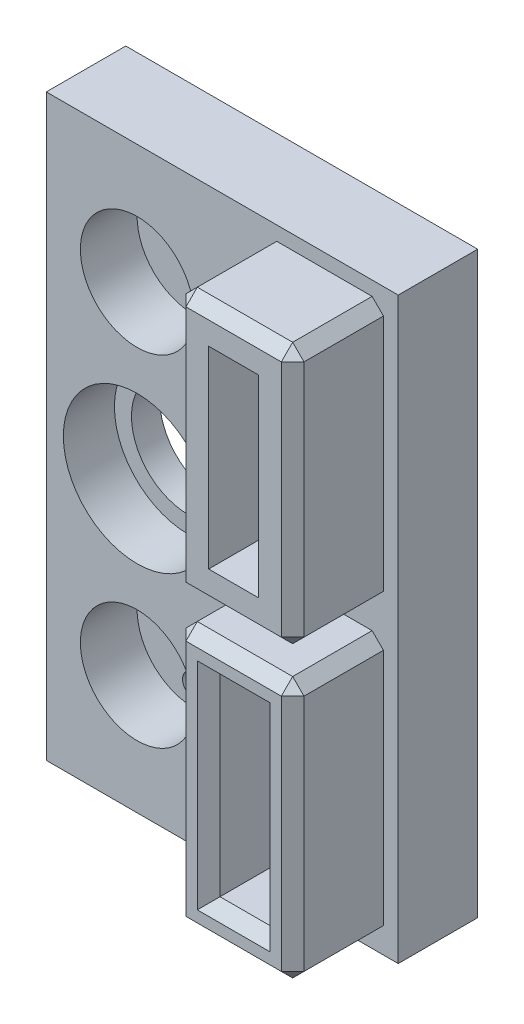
from build123d import *

# Parameters (mm, degrees)
SKETCH_1_W          = 30.82
SKETCH_1_H          = 51.6
SKETCH_1_R          = 5
SKETCH_1_R_2        = 3
EXTRUDE_1_DEPTH     = 5
SKETCH_4_W          = 30.823300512
SKETCH_4_H          = 51.6
EXTRUDE_4_DEPTH     = 2
CUT_EXTRUDE_START   = -10
SKETCH_5_R          = 3
CUT_EXTRUDE_1_DEPTH = 10
SKETCH_6_R          = 5
CUT_EXTRUDE_2_DEPTH = 2.6
SKETCH_7_R          = 6.5
CUT_EXTRUDE_3_DEPTH = 4.5
SKETCH_8_R          = 1
CUT_EXTRUDE_4_DEPTH = 10
SKETCH_11_R         = 1
CUT_EXTRUDE_6_DEPTH = 11
CUT_EXTRUDE_7_DEPTH = 11
SKETCH_14_W         = 0.29
SKETCH_14_H         = 51
EXTRUDE_7_DEPTH     = 7
SKETCH_15_W         = 2.657456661
SKETCH_15_H         = 0.18
SKETCH_15_W_2       = 31
CUT_EXTRUDE_8_DEPTH = 10
SKETCH_16_W         = 31
SKETCH_16_H         = 0.18
EXTRUDE_8_DEPTH     = 7
SKETCH_17_W         = 10.4
SKETCH_17_H         = 23
SKETCH_17_W_2       = 4.4
SKETCH_17_H_2       = 17
EXTRUDE_9_DEPTH     = 8
CHAMFER_4_SIZE      = 1


with BuildPart() as part:
    # Sketch 1 → Extrude 1 (new body)
    with BuildSketch(Plane.XY):
        with Locations((7.41, 0)):
            Rectangle(SKETCH_1_W, SKETCH_1_H)
        with Locations((0, 15)):
            Circle(SKETCH_1_R, mode=Mode.SUBTRACT)
        with Locations((0, -15)):
            Circle(SKETCH_1_R, mode=Mode.SUBTRACT)
        Circle(SKETCH_1_R_2, mode=Mode.SUBTRACT)
    extrude(amount=EXTRUDE_1_DEPTH)

    # Sketch 4 → Extrude 4 (add)
    with BuildSketch(Plane(origin=(0, 0, 0), x_dir=(-1, 0, 0), z_dir=(0, 0, -1))):
        with Locations((-7.411650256, 0)):
            Rectangle(SKETCH_4_W, SKETCH_4_H)
    extrude(amount=EXTRUDE_4_DEPTH)

    # Sketch 5 → Cut-Extrude 1 (cut)
    with BuildSketch(Plane.XY.offset(CUT_EXTRUDE_START)):
        with Locations(Location((0, 0, 0), (0, 0, 180))):
            Circle(SKETCH_5_R)
    extrude(amount=CUT_EXTRUDE_1_DEPTH, mode=Mode.SUBTRACT)

    # Sketch 6 → Cut-Extrude 2 (cut)
    with BuildSketch(Plane(origin=(0, 0, -2), x_dir=(-1, 0, 0), z_dir=(0, 0, -1))):
        Circle(SKETCH_6_R)
    extrude(amount=-CUT_EXTRUDE_2_DEPTH, mode=Mode.SUBTRACT)

    # Sketch 7 → Cut-Extrude 3 (cut)
    with BuildSketch(Plane.XY.offset(5)):
        Circle(SKETCH_7_R)
    extrude(amount=-CUT_EXTRUDE_3_DEPTH, mode=Mode.SUBTRACT)

    # Sketch 8 → Cut-Extrude 4 (cut)
    with BuildSketch(Plane.XY):
        with Locations((0, 15)):
            Circle(SKETCH_8_R)
        with Locations((0, -15)):
            Circle(SKETCH_8_R)
    extrude(amount=-CUT_EXTRUDE_4_DEPTH, mode=Mode.SUBTRACT)

    # Sketch 11 → Cut-Extrude 6 (cut)
    with BuildSketch(Plane(origin=(0, 0, -2), x_dir=(-1, 0, 0), z_dir=(0, 0, -1))):
        with Locations((0, -18.3)):
            Circle(SKETCH_11_R)
    extrude(amount=-CUT_EXTRUDE_6_DEPTH, mode=Mode.SUBTRACT)

    # Sketch 12 → Cut-Extrude 7 (cut)
    with BuildSketch(Plane.XY.offset(5)):
        Polygon((-8, -25.32), (-8, -25.8), (22.71, -25.8), (22.82, -25.8), (22.82, 25.8), (22.71, 25.8), (-8, 25.8), (-8, 25.68), (22.71, 25.68), (22.71, -25.32), align=None)
    extrude(amount=-CUT_EXTRUDE_7_DEPTH, mode=Mode.SUBTRACT)


with BuildPart() as cut_extrude_7_kept_piece:
    # of the separate pieces the step leaves, the one the design keeps (cut_extrude_7_pieces_kept)
    add(part.part.solids().sort_by_distance((-8, -25.32, 5))[0])

    # Sketch 14 → Extrude 7 (add)
    with BuildSketch(Plane(origin=(0, 0, -2), x_dir=(-1, 0, 0), z_dir=(0, 0, -1))):
        with Locations((-22.855, 0.18)):
            Rectangle(SKETCH_14_W, SKETCH_14_H)
    extrude(amount=-EXTRUDE_7_DEPTH)

    # Sketch 15 → Cut-Extrude 8 (cut)
    with BuildSketch(Plane.XY.offset(5)):
        with Locations((-9.328728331, 25.59)):
            Rectangle(SKETCH_15_W, SKETCH_15_H)
        with Locations((7.5, 25.59)):
            Rectangle(SKETCH_15_W_2, SKETCH_15_H)
    extrude(amount=-CUT_EXTRUDE_8_DEPTH, mode=Mode.SUBTRACT)

    # Sketch 16 → Extrude 8 (add)
    with BuildSketch(Plane.XY.offset(5)):
        with Locations((7.5, -25.41)):
            Rectangle(SKETCH_16_W, SKETCH_16_H)
    extrude(amount=-EXTRUDE_8_DEPTH)

    # Sketch 17 → Extrude 9 (add)
    # profile 1 of 2: a face of its own
    with BuildSketch(Plane.XY.offset(5)):
        with Locations((16.5, -12.75)):
            Rectangle(SKETCH_17_W, SKETCH_17_H)
        with Locations((16.5, -12.75)):
            Rectangle(SKETCH_17_W_2, SKETCH_17_H_2, mode=Mode.SUBTRACT)
    # profile 2 of 2: a face of its own
    with BuildSketch(Plane.XY.offset(5)):
        with Locations((16.5, 12.75)):
            Rectangle(SKETCH_17_W, SKETCH_17_H)
        with Locations((16.5, 12.75)):
            Rectangle(SKETCH_17_W_2, SKETCH_17_H_2, mode=Mode.SUBTRACT)
    extrude(amount=EXTRUDE_9_DEPTH)

    # Chamfer 4
    chamfer_4_edges = [cut_extrude_7_kept_piece.edges().sort_by_distance(p)[0] for p in [
        (21.7, -12.75, 13),
        (16.5, -1.25, 13),
        (11.3, -12.75, 13),
        (16.5, -24.25, 13),
        (21.7, -24.25, 9),
        (21.7, -1.25, 9),
        (11.3, -1.25, 9),
        (11.3, -24.25, 9),
        (18.7, -12.75, 13),
        (16.5, -4.25, 13),
        (14.3, -12.75, 13),
        (16.5, -21.25, 13),
        (21.7, 12.75, 13),
        (16.5, 24.25, 13),
        (11.3, 12.75, 13),
        (16.5, 1.25, 13),
        (21.7, 1.25, 9),
        (21.7, 24.25, 9),
        (11.3, 24.25, 9),
        (11.3, 1.25, 9),
    ]]
    chamfer(chamfer_4_edges, length=CHAMFER_4_SIZE)


solid = cut_extrude_7_kept_piece.part
